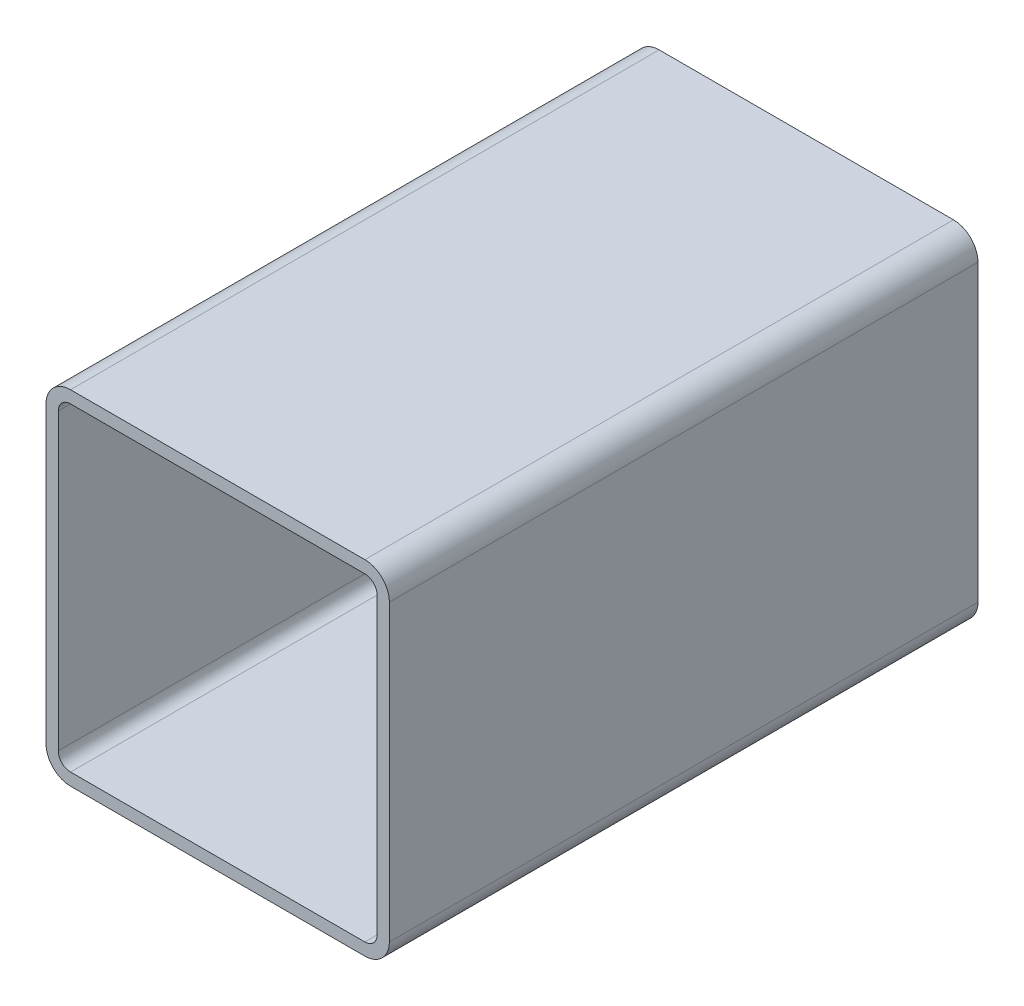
ISO-10303-21;
HEADER;
FILE_DESCRIPTION(('STEP AP214'),'2;1');
FILE_NAME('part.step','',(''),(''),'','','');
FILE_SCHEMA(('AUTOMOTIVE_DESIGN { 1 0 10303 214 1 1 1 1 }'));
ENDSEC;
DATA;
#1=APPLICATION_CONTEXT('core data for automotive mechanical design processes');
#2=APPLICATION_PROTOCOL_DEFINITION('international standard','automotive_design',2000,#1);
#3=PRODUCT_CONTEXT('',#1,'mechanical');
#4=PRODUCT('Part','Part','',(#3));
#5=PRODUCT_RELATED_PRODUCT_CATEGORY('part','',(#4));
#6=PRODUCT_DEFINITION_FORMATION('','',#4);
#7=PRODUCT_DEFINITION_CONTEXT('part definition',#1,'design');
#8=PRODUCT_DEFINITION('design','',#6,#7);
#9=PRODUCT_DEFINITION_SHAPE('','',#8);
#10=(LENGTH_UNIT() NAMED_UNIT(*) SI_UNIT(.MILLI.,.METRE.));
#11=(NAMED_UNIT(*) PLANE_ANGLE_UNIT() SI_UNIT($,.RADIAN.));
#12=(NAMED_UNIT(*) SI_UNIT($,.STERADIAN.) SOLID_ANGLE_UNIT());
#13=UNCERTAINTY_MEASURE_WITH_UNIT(LENGTH_MEASURE(1.E-05),#10,'distance_accuracy_value','');
#14=(GEOMETRIC_REPRESENTATION_CONTEXT(3) GLOBAL_UNCERTAINTY_ASSIGNED_CONTEXT((#13)) GLOBAL_UNIT_ASSIGNED_CONTEXT((#10,
#11,#12)) REPRESENTATION_CONTEXT('',''));
#15=CARTESIAN_POINT('',(0.,0.,0.));
#16=DIRECTION('',(0.,0.,1.));
#17=DIRECTION('',(1.,0.,0.));
#18=AXIS2_PLACEMENT_3D('',#15,#16,#17);
#19=CARTESIAN_POINT('',(14.9048786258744,167.089039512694,304.8));
#20=DIRECTION('',(0.,0.,1.));
#21=DIRECTION('',(1.,0.,0.));
#22=AXIS2_PLACEMENT_3D('',#19,#20,#21);
#23=PLANE('',#22);
#24=CARTESIAN_POINT('',(14.9048786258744,167.089039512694,304.8));
#25=DIRECTION('',(0.,0.,1.));
#26=DIRECTION('',(1.,0.,0.));
#27=AXIS2_PLACEMENT_3D('',#24,#25,#26);
#28=CIRCLE('',#27,12.7);
#29=CARTESIAN_POINT('',(14.9048786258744,179.789039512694,304.8));
#30=VERTEX_POINT('',#29);
#31=CARTESIAN_POINT('',(2.20487862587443,167.089039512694,304.8));
#32=VERTEX_POINT('',#31);
#33=EDGE_CURVE('E211',#30,#32,#28,.T.);
#34=ORIENTED_EDGE('',*,*,#33,.T.);
#35=DIRECTION('',(0.,-1.,0.));
#36=VECTOR('',#35,1.);
#37=CARTESIAN_POINT('',(2.20487862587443,14.6890395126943,304.8));
#38=LINE('',#37,#36);
#39=CARTESIAN_POINT('',(2.20487862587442,14.6890395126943,304.8));
#40=VERTEX_POINT('',#39);
#41=EDGE_CURVE('E214',#32,#40,#38,.T.);
#42=ORIENTED_EDGE('',*,*,#41,.T.);
#43=CARTESIAN_POINT('',(14.9048786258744,14.6890395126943,304.8));
#44=DIRECTION('',(0.,0.,1.));
#45=DIRECTION('',(1.,0.,0.));
#46=AXIS2_PLACEMENT_3D('',#43,#44,#45);
#47=CIRCLE('',#46,12.7);
#48=CARTESIAN_POINT('',(14.9048786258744,1.98903951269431,304.8));
#49=VERTEX_POINT('',#48);
#50=EDGE_CURVE('E217',#40,#49,#47,.T.);
#51=ORIENTED_EDGE('',*,*,#50,.T.);
#52=DIRECTION('',(1.,0.,0.));
#53=VECTOR('',#52,1.);
#54=CARTESIAN_POINT('',(167.304878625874,1.98903951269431,304.8));
#55=LINE('',#54,#53);
#56=CARTESIAN_POINT('',(167.304878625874,1.9890395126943,304.8));
#57=VERTEX_POINT('',#56);
#58=EDGE_CURVE('E219',#49,#57,#55,.T.);
#59=ORIENTED_EDGE('',*,*,#58,.T.);
#60=CARTESIAN_POINT('',(167.304878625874,14.6890395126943,304.8));
#61=DIRECTION('',(0.,0.,1.));
#62=DIRECTION('',(1.,0.,0.));
#63=AXIS2_PLACEMENT_3D('',#60,#61,#62);
#64=CIRCLE('',#63,12.7);
#65=CARTESIAN_POINT('',(180.004878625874,14.6890395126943,304.8));
#66=VERTEX_POINT('',#65);
#67=EDGE_CURVE('E221',#57,#66,#64,.T.);
#68=ORIENTED_EDGE('',*,*,#67,.T.);
#69=DIRECTION('',(0.,1.,0.));
#70=VECTOR('',#69,1.);
#71=CARTESIAN_POINT('',(180.004878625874,167.089039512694,304.8));
#72=LINE('',#71,#70);
#73=CARTESIAN_POINT('',(180.004878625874,167.089039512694,304.8));
#74=VERTEX_POINT('',#73);
#75=EDGE_CURVE('E223',#66,#74,#72,.T.);
#76=ORIENTED_EDGE('',*,*,#75,.T.);
#77=CARTESIAN_POINT('',(167.304878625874,167.089039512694,304.8));
#78=DIRECTION('',(0.,0.,1.));
#79=DIRECTION('',(1.,0.,0.));
#80=AXIS2_PLACEMENT_3D('',#77,#78,#79);
#81=CIRCLE('',#80,12.7);
#82=CARTESIAN_POINT('',(167.304878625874,179.789039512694,304.8));
#83=VERTEX_POINT('',#82);
#84=EDGE_CURVE('E225',#74,#83,#81,.T.);
#85=ORIENTED_EDGE('',*,*,#84,.T.);
#86=DIRECTION('',(-1.,0.,0.));
#87=VECTOR('',#86,1.);
#88=CARTESIAN_POINT('',(14.9048786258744,179.789039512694,304.8));
#89=LINE('',#88,#87);
#90=EDGE_CURVE('E227',#83,#30,#89,.T.);
#91=ORIENTED_EDGE('',*,*,#90,.T.);
#92=EDGE_LOOP('',(#34,#42,#51,#59,#68,#76,#85,#91));
#93=FACE_BOUND('',#92,.T.);
#94=DIRECTION('',(0.,-1.,0.));
#95=VECTOR('',#94,1.);
#96=CARTESIAN_POINT('',(8.55487862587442,14.6890395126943,304.8));
#97=LINE('',#96,#95);
#98=CARTESIAN_POINT('',(8.55487862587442,167.089039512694,304.8));
#99=VERTEX_POINT('',#98);
#100=CARTESIAN_POINT('',(8.55487862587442,14.6890395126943,304.8));
#101=VERTEX_POINT('',#100);
#102=EDGE_CURVE('E154',#99,#101,#97,.T.);
#103=ORIENTED_EDGE('',*,*,#102,.F.);
#104=CARTESIAN_POINT('',(14.9048786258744,167.089039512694,304.8));
#105=DIRECTION('',(0.,0.,1.));
#106=DIRECTION('',(1.,0.,0.));
#107=AXIS2_PLACEMENT_3D('',#104,#105,#106);
#108=CIRCLE('',#107,6.34999999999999);
#109=CARTESIAN_POINT('',(14.9048786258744,173.439039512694,304.8));
#110=VERTEX_POINT('',#109);
#111=EDGE_CURVE('E146',#110,#99,#108,.T.);
#112=ORIENTED_EDGE('',*,*,#111,.F.);
#113=DIRECTION('',(-1.,0.,0.));
#114=VECTOR('',#113,1.);
#115=CARTESIAN_POINT('',(14.9048786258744,173.439039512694,304.8));
#116=LINE('',#115,#114);
#117=CARTESIAN_POINT('',(167.304878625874,173.439039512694,304.8));
#118=VERTEX_POINT('',#117);
#119=EDGE_CURVE('E179',#118,#110,#116,.T.);
#120=ORIENTED_EDGE('',*,*,#119,.F.);
#121=CARTESIAN_POINT('',(167.304878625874,167.089039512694,304.8));
#122=DIRECTION('',(0.,0.,1.));
#123=DIRECTION('',(1.,0.,0.));
#124=AXIS2_PLACEMENT_3D('',#121,#122,#123);
#125=CIRCLE('',#124,6.34999999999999);
#126=CARTESIAN_POINT('',(173.654878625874,167.089039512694,304.8));
#127=VERTEX_POINT('',#126);
#128=EDGE_CURVE('E177',#127,#118,#125,.T.);
#129=ORIENTED_EDGE('',*,*,#128,.F.);
#130=DIRECTION('',(0.,1.,0.));
#131=VECTOR('',#130,1.);
#132=CARTESIAN_POINT('',(173.654878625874,167.089039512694,304.8));
#133=LINE('',#132,#131);
#134=CARTESIAN_POINT('',(173.654878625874,14.6890395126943,304.8));
#135=VERTEX_POINT('',#134);
#136=EDGE_CURVE('E175',#135,#127,#133,.T.);
#137=ORIENTED_EDGE('',*,*,#136,.F.);
#138=CARTESIAN_POINT('',(167.304878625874,14.6890395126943,304.8));
#139=DIRECTION('',(0.,0.,1.));
#140=DIRECTION('',(1.,0.,0.));
#141=AXIS2_PLACEMENT_3D('',#138,#139,#140);
#142=CIRCLE('',#141,6.35);
#143=CARTESIAN_POINT('',(167.304878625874,8.33903951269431,304.8));
#144=VERTEX_POINT('',#143);
#145=EDGE_CURVE('E173',#144,#135,#142,.T.);
#146=ORIENTED_EDGE('',*,*,#145,.F.);
#147=DIRECTION('',(1.,0.,0.));
#148=VECTOR('',#147,1.);
#149=CARTESIAN_POINT('',(167.304878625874,8.33903951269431,304.8));
#150=LINE('',#149,#148);
#151=CARTESIAN_POINT('',(14.9048786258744,8.33903951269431,304.8));
#152=VERTEX_POINT('',#151);
#153=EDGE_CURVE('E169',#152,#144,#150,.T.);
#154=ORIENTED_EDGE('',*,*,#153,.F.);
#155=CARTESIAN_POINT('',(14.9048786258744,14.6890395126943,304.8));
#156=DIRECTION('',(0.,0.,1.));
#157=DIRECTION('',(1.,0.,0.));
#158=AXIS2_PLACEMENT_3D('',#155,#156,#157);
#159=CIRCLE('',#158,6.35);
#160=EDGE_CURVE('E167',#101,#152,#159,.T.);
#161=ORIENTED_EDGE('',*,*,#160,.F.);
#162=EDGE_LOOP('',(#103,#112,#120,#129,#137,#146,#154,#161));
#163=FACE_BOUND('',#162,.T.);
#164=ADVANCED_FACE('F33',(#93,#163),#23,.T.);
#165=CARTESIAN_POINT('',(14.9048786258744,167.089039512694,0.));
#166=DIRECTION('',(0.,0.,1.));
#167=DIRECTION('',(1.,0.,0.));
#168=AXIS2_PLACEMENT_3D('',#165,#166,#167);
#169=PLANE('',#168);
#170=CARTESIAN_POINT('',(14.9048786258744,167.089039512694,0.));
#171=DIRECTION('',(0.,0.,1.));
#172=DIRECTION('',(1.,0.,0.));
#173=AXIS2_PLACEMENT_3D('',#170,#171,#172);
#174=CIRCLE('',#173,12.7);
#175=CARTESIAN_POINT('',(14.9048786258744,179.789039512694,0.));
#176=VERTEX_POINT('',#175);
#177=CARTESIAN_POINT('',(2.20487862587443,167.089039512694,0.));
#178=VERTEX_POINT('',#177);
#179=EDGE_CURVE('E162',#176,#178,#174,.T.);
#180=ORIENTED_EDGE('',*,*,#179,.F.);
#181=DIRECTION('',(-1.,0.,0.));
#182=VECTOR('',#181,1.);
#183=CARTESIAN_POINT('',(14.9048786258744,179.789039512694,0.));
#184=LINE('',#183,#182);
#185=CARTESIAN_POINT('',(167.304878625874,179.789039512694,0.));
#186=VERTEX_POINT('',#185);
#187=EDGE_CURVE('E215',#186,#176,#184,.T.);
#188=ORIENTED_EDGE('',*,*,#187,.F.);
#189=CARTESIAN_POINT('',(167.304878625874,167.089039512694,0.));
#190=DIRECTION('',(0.,0.,1.));
#191=DIRECTION('',(1.,0.,0.));
#192=AXIS2_PLACEMENT_3D('',#189,#190,#191);
#193=CIRCLE('',#192,12.7);
#194=CARTESIAN_POINT('',(180.004878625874,167.089039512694,0.));
#195=VERTEX_POINT('',#194);
#196=EDGE_CURVE('E242',#195,#186,#193,.T.);
#197=ORIENTED_EDGE('',*,*,#196,.F.);
#198=DIRECTION('',(0.,1.,0.));
#199=VECTOR('',#198,1.);
#200=CARTESIAN_POINT('',(180.004878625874,167.089039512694,0.));
#201=LINE('',#200,#199);
#202=CARTESIAN_POINT('',(180.004878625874,14.6890395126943,0.));
#203=VERTEX_POINT('',#202);
#204=EDGE_CURVE('E240',#203,#195,#201,.T.);
#205=ORIENTED_EDGE('',*,*,#204,.F.);
#206=CARTESIAN_POINT('',(167.304878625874,14.6890395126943,0.));
#207=DIRECTION('',(0.,0.,1.));
#208=DIRECTION('',(1.,0.,0.));
#209=AXIS2_PLACEMENT_3D('',#206,#207,#208);
#210=CIRCLE('',#209,12.7);
#211=CARTESIAN_POINT('',(167.304878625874,1.9890395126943,0.));
#212=VERTEX_POINT('',#211);
#213=EDGE_CURVE('E238',#212,#203,#210,.T.);
#214=ORIENTED_EDGE('',*,*,#213,.F.);
#215=DIRECTION('',(1.,0.,0.));
#216=VECTOR('',#215,1.);
#217=CARTESIAN_POINT('',(167.304878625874,1.98903951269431,0.));
#218=LINE('',#217,#216);
#219=CARTESIAN_POINT('',(14.9048786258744,1.98903951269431,0.));
#220=VERTEX_POINT('',#219);
#221=EDGE_CURVE('E236',#220,#212,#218,.T.);
#222=ORIENTED_EDGE('',*,*,#221,.F.);
#223=CARTESIAN_POINT('',(14.9048786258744,14.6890395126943,0.));
#224=DIRECTION('',(0.,0.,1.));
#225=DIRECTION('',(1.,0.,0.));
#226=AXIS2_PLACEMENT_3D('',#223,#224,#225);
#227=CIRCLE('',#226,12.7);
#228=CARTESIAN_POINT('',(2.20487862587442,14.6890395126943,0.));
#229=VERTEX_POINT('',#228);
#230=EDGE_CURVE('E234',#229,#220,#227,.T.);
#231=ORIENTED_EDGE('',*,*,#230,.F.);
#232=DIRECTION('',(0.,-1.,0.));
#233=VECTOR('',#232,1.);
#234=CARTESIAN_POINT('',(2.20487862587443,14.6890395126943,0.));
#235=LINE('',#234,#233);
#236=EDGE_CURVE('E232',#178,#229,#235,.T.);
#237=ORIENTED_EDGE('',*,*,#236,.F.);
#238=EDGE_LOOP('',(#180,#188,#197,#205,#214,#222,#231,#237));
#239=FACE_BOUND('',#238,.T.);
#240=CARTESIAN_POINT('',(14.9048786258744,167.089039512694,0.));
#241=DIRECTION('',(0.,0.,1.));
#242=DIRECTION('',(1.,0.,0.));
#243=AXIS2_PLACEMENT_3D('',#240,#241,#242);
#244=CIRCLE('',#243,6.34999999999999);
#245=CARTESIAN_POINT('',(14.9048786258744,173.439039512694,0.));
#246=VERTEX_POINT('',#245);
#247=CARTESIAN_POINT('',(8.55487862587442,167.089039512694,0.));
#248=VERTEX_POINT('',#247);
#249=EDGE_CURVE('E56',#246,#248,#244,.T.);
#250=ORIENTED_EDGE('',*,*,#249,.T.);
#251=DIRECTION('',(0.,-1.,0.));
#252=VECTOR('',#251,1.);
#253=CARTESIAN_POINT('',(8.55487862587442,14.6890395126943,0.));
#254=LINE('',#253,#252);
#255=CARTESIAN_POINT('',(8.55487862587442,14.6890395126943,0.));
#256=VERTEX_POINT('',#255);
#257=EDGE_CURVE('E161',#248,#256,#254,.T.);
#258=ORIENTED_EDGE('',*,*,#257,.T.);
#259=CARTESIAN_POINT('',(14.9048786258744,14.6890395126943,0.));
#260=DIRECTION('',(0.,0.,1.));
#261=DIRECTION('',(1.,0.,0.));
#262=AXIS2_PLACEMENT_3D('',#259,#260,#261);
#263=CIRCLE('',#262,6.35);
#264=CARTESIAN_POINT('',(14.9048786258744,8.33903951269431,0.));
#265=VERTEX_POINT('',#264);
#266=EDGE_CURVE('E183',#256,#265,#263,.T.);
#267=ORIENTED_EDGE('',*,*,#266,.T.);
#268=DIRECTION('',(1.,0.,0.));
#269=VECTOR('',#268,1.);
#270=CARTESIAN_POINT('',(167.304878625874,8.33903951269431,0.));
#271=LINE('',#270,#269);
#272=CARTESIAN_POINT('',(167.304878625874,8.33903951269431,0.));
#273=VERTEX_POINT('',#272);
#274=EDGE_CURVE('E186',#265,#273,#271,.T.);
#275=ORIENTED_EDGE('',*,*,#274,.T.);
#276=CARTESIAN_POINT('',(167.304878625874,14.6890395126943,0.));
#277=DIRECTION('',(0.,0.,1.));
#278=DIRECTION('',(1.,0.,0.));
#279=AXIS2_PLACEMENT_3D('',#276,#277,#278);
#280=CIRCLE('',#279,6.35);
#281=CARTESIAN_POINT('',(173.654878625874,14.6890395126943,0.));
#282=VERTEX_POINT('',#281);
#283=EDGE_CURVE('E189',#273,#282,#280,.T.);
#284=ORIENTED_EDGE('',*,*,#283,.T.);
#285=DIRECTION('',(0.,1.,0.));
#286=VECTOR('',#285,1.);
#287=CARTESIAN_POINT('',(173.654878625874,167.089039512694,0.));
#288=LINE('',#287,#286);
#289=CARTESIAN_POINT('',(173.654878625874,167.089039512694,0.));
#290=VERTEX_POINT('',#289);
#291=EDGE_CURVE('E192',#282,#290,#288,.T.);
#292=ORIENTED_EDGE('',*,*,#291,.T.);
#293=CARTESIAN_POINT('',(167.304878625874,167.089039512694,0.));
#294=DIRECTION('',(0.,0.,1.));
#295=DIRECTION('',(1.,0.,0.));
#296=AXIS2_PLACEMENT_3D('',#293,#294,#295);
#297=CIRCLE('',#296,6.34999999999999);
#298=CARTESIAN_POINT('',(167.304878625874,173.439039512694,0.));
#299=VERTEX_POINT('',#298);
#300=EDGE_CURVE('E195',#290,#299,#297,.T.);
#301=ORIENTED_EDGE('',*,*,#300,.T.);
#302=DIRECTION('',(-1.,0.,0.));
#303=VECTOR('',#302,1.);
#304=CARTESIAN_POINT('',(14.9048786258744,173.439039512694,0.));
#305=LINE('',#304,#303);
#306=EDGE_CURVE('E155',#299,#246,#305,.T.);
#307=ORIENTED_EDGE('',*,*,#306,.T.);
#308=EDGE_LOOP('',(#250,#258,#267,#275,#284,#292,#301,#307));
#309=FACE_BOUND('',#308,.T.);
#310=ADVANCED_FACE('F272',(#239,#309),#169,.F.);
#311=CARTESIAN_POINT('',(14.9048786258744,167.089039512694,304.8));
#312=DIRECTION('',(0.,0.,-1.));
#313=DIRECTION('',(-1.,0.,0.));
#314=AXIS2_PLACEMENT_3D('',#311,#312,#313);
#315=CYLINDRICAL_SURFACE('',#314,12.7);
#316=ORIENTED_EDGE('',*,*,#179,.T.);
#317=DIRECTION('',(0.,0.,-1.));
#318=VECTOR('',#317,1.);
#319=CARTESIAN_POINT('',(2.20487862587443,167.089039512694,304.8));
#320=LINE('',#319,#318);
#321=EDGE_CURVE('E11',#32,#178,#320,.T.);
#322=ORIENTED_EDGE('',*,*,#321,.F.);
#323=ORIENTED_EDGE('',*,*,#33,.F.);
#324=DIRECTION('',(0.,0.,-1.));
#325=VECTOR('',#324,1.);
#326=CARTESIAN_POINT('',(14.9048786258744,179.789039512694,304.8));
#327=LINE('',#326,#325);
#328=EDGE_CURVE('E229',#30,#176,#327,.T.);
#329=ORIENTED_EDGE('',*,*,#328,.T.);
#330=EDGE_LOOP('',(#316,#322,#323,#329));
#331=FACE_BOUND('',#330,.T.);
#332=ADVANCED_FACE('F35',(#331),#315,.T.);
#333=CARTESIAN_POINT('',(2.20487862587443,14.6890395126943,304.8));
#334=DIRECTION('',(1.,0.,0.));
#335=DIRECTION('',(0.,0.,-1.));
#336=AXIS2_PLACEMENT_3D('',#333,#334,#335);
#337=PLANE('',#336);
#338=ORIENTED_EDGE('',*,*,#236,.T.);
#339=DIRECTION('',(0.,0.,-1.));
#340=VECTOR('',#339,1.);
#341=CARTESIAN_POINT('',(2.20487862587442,14.6890395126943,304.8));
#342=LINE('',#341,#340);
#343=EDGE_CURVE('E41',#40,#229,#342,.T.);
#344=ORIENTED_EDGE('',*,*,#343,.F.);
#345=ORIENTED_EDGE('',*,*,#41,.F.);
#346=ORIENTED_EDGE('',*,*,#321,.T.);
#347=EDGE_LOOP('',(#338,#344,#345,#346));
#348=FACE_BOUND('',#347,.T.);
#349=ADVANCED_FACE('F289',(#348),#337,.F.);
#350=CARTESIAN_POINT('',(14.9048786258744,14.6890395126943,304.8));
#351=DIRECTION('',(0.,0.,-1.));
#352=DIRECTION('',(-1.,0.,0.));
#353=AXIS2_PLACEMENT_3D('',#350,#351,#352);
#354=CYLINDRICAL_SURFACE('',#353,12.7);
#355=ORIENTED_EDGE('',*,*,#230,.T.);
#356=DIRECTION('',(0.,0.,-1.));
#357=VECTOR('',#356,1.);
#358=CARTESIAN_POINT('',(14.9048786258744,1.98903951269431,304.8));
#359=LINE('',#358,#357);
#360=EDGE_CURVE('E259',#49,#220,#359,.T.);
#361=ORIENTED_EDGE('',*,*,#360,.F.);
#362=ORIENTED_EDGE('',*,*,#50,.F.);
#363=ORIENTED_EDGE('',*,*,#343,.T.);
#364=EDGE_LOOP('',(#355,#361,#362,#363));
#365=FACE_BOUND('',#364,.T.);
#366=ADVANCED_FACE('F266',(#365),#354,.T.);
#367=CARTESIAN_POINT('',(167.304878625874,1.98903951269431,304.8));
#368=DIRECTION('',(0.,1.,0.));
#369=DIRECTION('',(0.,0.,1.));
#370=AXIS2_PLACEMENT_3D('',#367,#368,#369);
#371=PLANE('',#370);
#372=ORIENTED_EDGE('',*,*,#221,.T.);
#373=DIRECTION('',(0.,0.,-1.));
#374=VECTOR('',#373,1.);
#375=CARTESIAN_POINT('',(167.304878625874,1.9890395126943,304.8));
#376=LINE('',#375,#374);
#377=EDGE_CURVE('E256',#57,#212,#376,.T.);
#378=ORIENTED_EDGE('',*,*,#377,.F.);
#379=ORIENTED_EDGE('',*,*,#58,.F.);
#380=ORIENTED_EDGE('',*,*,#360,.T.);
#381=EDGE_LOOP('',(#372,#378,#379,#380));
#382=FACE_BOUND('',#381,.T.);
#383=ADVANCED_FACE('F278',(#382),#371,.F.);
#384=CARTESIAN_POINT('',(167.304878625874,14.6890395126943,304.8));
#385=DIRECTION('',(0.,0.,-1.));
#386=DIRECTION('',(-1.,0.,0.));
#387=AXIS2_PLACEMENT_3D('',#384,#385,#386);
#388=CYLINDRICAL_SURFACE('',#387,12.7);
#389=ORIENTED_EDGE('',*,*,#213,.T.);
#390=DIRECTION('',(0.,0.,-1.));
#391=VECTOR('',#390,1.);
#392=CARTESIAN_POINT('',(180.004878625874,14.6890395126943,304.8));
#393=LINE('',#392,#391);
#394=EDGE_CURVE('E253',#66,#203,#393,.T.);
#395=ORIENTED_EDGE('',*,*,#394,.F.);
#396=ORIENTED_EDGE('',*,*,#67,.F.);
#397=ORIENTED_EDGE('',*,*,#377,.T.);
#398=EDGE_LOOP('',(#389,#395,#396,#397));
#399=FACE_BOUND('',#398,.T.);
#400=ADVANCED_FACE('F282',(#399),#388,.T.);
#401=CARTESIAN_POINT('',(180.004878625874,167.089039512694,304.8));
#402=DIRECTION('',(-1.,0.,0.));
#403=DIRECTION('',(0.,0.,1.));
#404=AXIS2_PLACEMENT_3D('',#401,#402,#403);
#405=PLANE('',#404);
#406=ORIENTED_EDGE('',*,*,#204,.T.);
#407=DIRECTION('',(0.,0.,-1.));
#408=VECTOR('',#407,1.);
#409=CARTESIAN_POINT('',(180.004878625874,167.089039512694,304.8));
#410=LINE('',#409,#408);
#411=EDGE_CURVE('E250',#74,#195,#410,.T.);
#412=ORIENTED_EDGE('',*,*,#411,.F.);
#413=ORIENTED_EDGE('',*,*,#75,.F.);
#414=ORIENTED_EDGE('',*,*,#394,.T.);
#415=EDGE_LOOP('',(#406,#412,#413,#414));
#416=FACE_BOUND('',#415,.T.);
#417=ADVANCED_FACE('F302',(#416),#405,.F.);
#418=CARTESIAN_POINT('',(167.304878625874,167.089039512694,304.8));
#419=DIRECTION('',(0.,0.,-1.));
#420=DIRECTION('',(-1.,0.,0.));
#421=AXIS2_PLACEMENT_3D('',#418,#419,#420);
#422=CYLINDRICAL_SURFACE('',#421,12.7);
#423=ORIENTED_EDGE('',*,*,#196,.T.);
#424=DIRECTION('',(0.,0.,-1.));
#425=VECTOR('',#424,1.);
#426=CARTESIAN_POINT('',(167.304878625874,179.789039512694,304.8));
#427=LINE('',#426,#425);
#428=EDGE_CURVE('E247',#83,#186,#427,.T.);
#429=ORIENTED_EDGE('',*,*,#428,.F.);
#430=ORIENTED_EDGE('',*,*,#84,.F.);
#431=ORIENTED_EDGE('',*,*,#411,.T.);
#432=EDGE_LOOP('',(#423,#429,#430,#431));
#433=FACE_BOUND('',#432,.T.);
#434=ADVANCED_FACE('F300',(#433),#422,.T.);
#435=CARTESIAN_POINT('',(14.9048786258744,179.789039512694,304.8));
#436=DIRECTION('',(0.,-1.,0.));
#437=DIRECTION('',(0.,0.,-1.));
#438=AXIS2_PLACEMENT_3D('',#435,#436,#437);
#439=PLANE('',#438);
#440=ORIENTED_EDGE('',*,*,#187,.T.);
#441=ORIENTED_EDGE('',*,*,#328,.F.);
#442=ORIENTED_EDGE('',*,*,#90,.F.);
#443=ORIENTED_EDGE('',*,*,#428,.T.);
#444=EDGE_LOOP('',(#440,#441,#442,#443));
#445=FACE_BOUND('',#444,.T.);
#446=ADVANCED_FACE('F295',(#445),#439,.F.);
#447=CARTESIAN_POINT('',(14.9048786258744,167.089039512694,304.8));
#448=DIRECTION('',(0.,0.,-1.));
#449=DIRECTION('',(-1.,0.,0.));
#450=AXIS2_PLACEMENT_3D('',#447,#448,#449);
#451=CYLINDRICAL_SURFACE('',#450,6.34999999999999);
#452=ORIENTED_EDGE('',*,*,#249,.F.);
#453=DIRECTION('',(0.,0.,-1.));
#454=VECTOR('',#453,1.);
#455=CARTESIAN_POINT('',(14.9048786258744,173.439039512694,304.8));
#456=LINE('',#455,#454);
#457=EDGE_CURVE('E150',#110,#246,#456,.T.);
#458=ORIENTED_EDGE('',*,*,#457,.F.);
#459=ORIENTED_EDGE('',*,*,#111,.T.);
#460=DIRECTION('',(0.,0.,-1.));
#461=VECTOR('',#460,1.);
#462=CARTESIAN_POINT('',(8.55487862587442,167.089039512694,304.8));
#463=LINE('',#462,#461);
#464=EDGE_CURVE('E149',#99,#248,#463,.T.);
#465=ORIENTED_EDGE('',*,*,#464,.T.);
#466=EDGE_LOOP('',(#452,#458,#459,#465));
#467=FACE_BOUND('',#466,.T.);
#468=ADVANCED_FACE('F148',(#467),#451,.F.);
#469=CARTESIAN_POINT('',(8.55487862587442,14.6890395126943,304.8));
#470=DIRECTION('',(1.,0.,0.));
#471=DIRECTION('',(0.,0.,-1.));
#472=AXIS2_PLACEMENT_3D('',#469,#470,#471);
#473=PLANE('',#472);
#474=ORIENTED_EDGE('',*,*,#257,.F.);
#475=ORIENTED_EDGE('',*,*,#464,.F.);
#476=ORIENTED_EDGE('',*,*,#102,.T.);
#477=DIRECTION('',(0.,0.,-1.));
#478=VECTOR('',#477,1.);
#479=CARTESIAN_POINT('',(8.55487862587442,14.6890395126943,304.8));
#480=LINE('',#479,#478);
#481=EDGE_CURVE('E163',#101,#256,#480,.T.);
#482=ORIENTED_EDGE('',*,*,#481,.T.);
#483=EDGE_LOOP('',(#474,#475,#476,#482));
#484=FACE_BOUND('',#483,.T.);
#485=ADVANCED_FACE('F158',(#484),#473,.T.);
#486=CARTESIAN_POINT('',(14.9048786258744,14.6890395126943,304.8));
#487=DIRECTION('',(0.,0.,-1.));
#488=DIRECTION('',(-1.,0.,0.));
#489=AXIS2_PLACEMENT_3D('',#486,#487,#488);
#490=CYLINDRICAL_SURFACE('',#489,6.35);
#491=ORIENTED_EDGE('',*,*,#266,.F.);
#492=ORIENTED_EDGE('',*,*,#481,.F.);
#493=ORIENTED_EDGE('',*,*,#160,.T.);
#494=DIRECTION('',(0.,0.,-1.));
#495=VECTOR('',#494,1.);
#496=CARTESIAN_POINT('',(14.9048786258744,8.33903951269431,304.8));
#497=LINE('',#496,#495);
#498=EDGE_CURVE('E208',#152,#265,#497,.T.);
#499=ORIENTED_EDGE('',*,*,#498,.T.);
#500=EDGE_LOOP('',(#491,#492,#493,#499));
#501=FACE_BOUND('',#500,.T.);
#502=ADVANCED_FACE('F327',(#501),#490,.F.);
#503=CARTESIAN_POINT('',(167.304878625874,8.33903951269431,304.8));
#504=DIRECTION('',(0.,1.,0.));
#505=DIRECTION('',(0.,0.,1.));
#506=AXIS2_PLACEMENT_3D('',#503,#504,#505);
#507=PLANE('',#506);
#508=ORIENTED_EDGE('',*,*,#274,.F.);
#509=ORIENTED_EDGE('',*,*,#498,.F.);
#510=ORIENTED_EDGE('',*,*,#153,.T.);
#511=DIRECTION('',(0.,0.,-1.));
#512=VECTOR('',#511,1.);
#513=CARTESIAN_POINT('',(167.304878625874,8.33903951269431,304.8));
#514=LINE('',#513,#512);
#515=EDGE_CURVE('E206',#144,#273,#514,.T.);
#516=ORIENTED_EDGE('',*,*,#515,.T.);
#517=EDGE_LOOP('',(#508,#509,#510,#516));
#518=FACE_BOUND('',#517,.T.);
#519=ADVANCED_FACE('F331',(#518),#507,.T.);
#520=CARTESIAN_POINT('',(167.304878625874,14.6890395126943,304.8));
#521=DIRECTION('',(0.,0.,-1.));
#522=DIRECTION('',(-1.,0.,0.));
#523=AXIS2_PLACEMENT_3D('',#520,#521,#522);
#524=CYLINDRICAL_SURFACE('',#523,6.35);
#525=ORIENTED_EDGE('',*,*,#283,.F.);
#526=ORIENTED_EDGE('',*,*,#515,.F.);
#527=ORIENTED_EDGE('',*,*,#145,.T.);
#528=DIRECTION('',(0.,0.,-1.));
#529=VECTOR('',#528,1.);
#530=CARTESIAN_POINT('',(173.654878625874,14.6890395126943,304.8));
#531=LINE('',#530,#529);
#532=EDGE_CURVE('E204',#135,#282,#531,.T.);
#533=ORIENTED_EDGE('',*,*,#532,.T.);
#534=EDGE_LOOP('',(#525,#526,#527,#533));
#535=FACE_BOUND('',#534,.T.);
#536=ADVANCED_FACE('F337',(#535),#524,.F.);
#537=CARTESIAN_POINT('',(173.654878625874,167.089039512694,304.8));
#538=DIRECTION('',(-1.,0.,0.));
#539=DIRECTION('',(0.,0.,1.));
#540=AXIS2_PLACEMENT_3D('',#537,#538,#539);
#541=PLANE('',#540);
#542=ORIENTED_EDGE('',*,*,#291,.F.);
#543=ORIENTED_EDGE('',*,*,#532,.F.);
#544=ORIENTED_EDGE('',*,*,#136,.T.);
#545=DIRECTION('',(0.,0.,-1.));
#546=VECTOR('',#545,1.);
#547=CARTESIAN_POINT('',(173.654878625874,167.089039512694,304.8));
#548=LINE('',#547,#546);
#549=EDGE_CURVE('E202',#127,#290,#548,.T.);
#550=ORIENTED_EDGE('',*,*,#549,.T.);
#551=EDGE_LOOP('',(#542,#543,#544,#550));
#552=FACE_BOUND('',#551,.T.);
#553=ADVANCED_FACE('F341',(#552),#541,.T.);
#554=CARTESIAN_POINT('',(167.304878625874,167.089039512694,304.8));
#555=DIRECTION('',(0.,0.,-1.));
#556=DIRECTION('',(-1.,0.,0.));
#557=AXIS2_PLACEMENT_3D('',#554,#555,#556);
#558=CYLINDRICAL_SURFACE('',#557,6.34999999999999);
#559=ORIENTED_EDGE('',*,*,#300,.F.);
#560=ORIENTED_EDGE('',*,*,#549,.F.);
#561=ORIENTED_EDGE('',*,*,#128,.T.);
#562=DIRECTION('',(0.,0.,-1.));
#563=VECTOR('',#562,1.);
#564=CARTESIAN_POINT('',(167.304878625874,173.439039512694,304.8));
#565=LINE('',#564,#563);
#566=EDGE_CURVE('E48',#118,#299,#565,.T.);
#567=ORIENTED_EDGE('',*,*,#566,.T.);
#568=EDGE_LOOP('',(#559,#560,#561,#567));
#569=FACE_BOUND('',#568,.T.);
#570=ADVANCED_FACE('F345',(#569),#558,.F.);
#571=CARTESIAN_POINT('',(14.9048786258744,173.439039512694,304.8));
#572=DIRECTION('',(0.,-1.,0.));
#573=DIRECTION('',(0.,0.,-1.));
#574=AXIS2_PLACEMENT_3D('',#571,#572,#573);
#575=PLANE('',#574);
#576=ORIENTED_EDGE('',*,*,#306,.F.);
#577=ORIENTED_EDGE('',*,*,#566,.F.);
#578=ORIENTED_EDGE('',*,*,#119,.T.);
#579=ORIENTED_EDGE('',*,*,#457,.T.);
#580=EDGE_LOOP('',(#576,#577,#578,#579));
#581=FACE_BOUND('',#580,.T.);
#582=ADVANCED_FACE('F349',(#581),#575,.T.);
#583=CLOSED_SHELL('',(#164,#310,#332,#349,#366,#383,#400,#417,#434,#446,#468,#485,#502,#519,
#536,#553,#570,#582));
#584=MANIFOLD_SOLID_BREP('B2',#583);
#585=ADVANCED_BREP_SHAPE_REPRESENTATION('',(#18,#584),#14);
#586=SHAPE_DEFINITION_REPRESENTATION(#9,#585);
ENDSEC;
END-ISO-10303-21;
